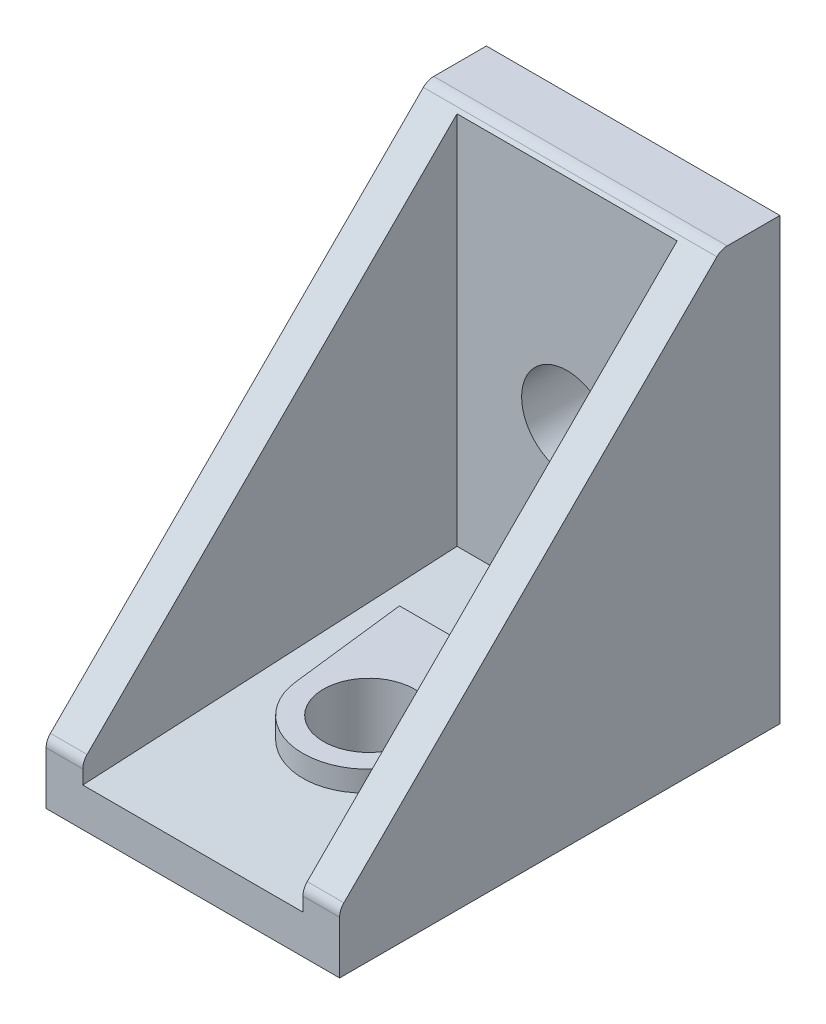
ISO-10303-21;
HEADER;
FILE_DESCRIPTION(('STEP AP214'),'2;1');
FILE_NAME('part.step','',(''),(''),'','','');
FILE_SCHEMA(('AUTOMOTIVE_DESIGN { 1 0 10303 214 1 1 1 1 }'));
ENDSEC;
DATA;
#1=APPLICATION_CONTEXT('core data for automotive mechanical design processes');
#2=APPLICATION_PROTOCOL_DEFINITION('international standard','automotive_design',2000,#1);
#3=PRODUCT_CONTEXT('',#1,'mechanical');
#4=PRODUCT('Part','Part','',(#3));
#5=PRODUCT_RELATED_PRODUCT_CATEGORY('part','',(#4));
#6=PRODUCT_DEFINITION_FORMATION('','',#4);
#7=PRODUCT_DEFINITION_CONTEXT('part definition',#1,'design');
#8=PRODUCT_DEFINITION('design','',#6,#7);
#9=PRODUCT_DEFINITION_SHAPE('','',#8);
#10=(LENGTH_UNIT() NAMED_UNIT(*) SI_UNIT(.MILLI.,.METRE.));
#11=(NAMED_UNIT(*) PLANE_ANGLE_UNIT() SI_UNIT($,.RADIAN.));
#12=(NAMED_UNIT(*) SI_UNIT($,.STERADIAN.) SOLID_ANGLE_UNIT());
#13=UNCERTAINTY_MEASURE_WITH_UNIT(LENGTH_MEASURE(1.E-05),#10,'distance_accuracy_value','');
#14=(GEOMETRIC_REPRESENTATION_CONTEXT(3) GLOBAL_UNCERTAINTY_ASSIGNED_CONTEXT((#13)) GLOBAL_UNIT_ASSIGNED_CONTEXT((#10,
#11,#12)) REPRESENTATION_CONTEXT('',''));
#15=CARTESIAN_POINT('',(0.,0.,0.));
#16=DIRECTION('',(0.,0.,1.));
#17=DIRECTION('',(1.,0.,0.));
#18=AXIS2_PLACEMENT_3D('',#15,#16,#17);
#19=CARTESIAN_POINT('',(10.,29.7071067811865,4.29310678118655));
#20=DIRECTION('',(0.,-0.707106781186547,-0.707106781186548));
#21=DIRECTION('',(0.,0.707106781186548,-0.707106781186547));
#22=AXIS2_PLACEMENT_3D('',#19,#20,#21);
#23=PLANE('',#22);
#24=DIRECTION('',(0.,-0.707106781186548,0.707106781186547));
#25=VECTOR('',#24,1.);
#26=CARTESIAN_POINT('',(-7.5,29.7071067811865,4.29310678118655));
#27=LINE('',#26,#25);
#28=CARTESIAN_POINT('',(-7.5,29.5002135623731,4.5));
#29=VERTEX_POINT('',#28);
#30=CARTESIAN_POINT('',(-7.5,4.29310678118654,29.7071067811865));
#31=VERTEX_POINT('',#30);
#32=EDGE_CURVE('E285',#29,#31,#27,.T.);
#33=ORIENTED_EDGE('',*,*,#32,.F.);
#34=DIRECTION('',(1.,0.,0.));
#35=VECTOR('',#34,1.);
#36=CARTESIAN_POINT('',(10.,29.5002135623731,4.5));
#37=LINE('',#36,#35);
#38=CARTESIAN_POINT('',(7.5,29.5002135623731,4.5));
#39=VERTEX_POINT('',#38);
#40=EDGE_CURVE('E11',#29,#39,#37,.T.);
#41=ORIENTED_EDGE('',*,*,#40,.T.);
#42=DIRECTION('',(0.,-0.707106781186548,0.707106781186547));
#43=VECTOR('',#42,1.);
#44=CARTESIAN_POINT('',(7.5,29.7071067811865,4.29310678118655));
#45=LINE('',#44,#43);
#46=CARTESIAN_POINT('',(7.5,4.29310678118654,29.7071067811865));
#47=VERTEX_POINT('',#46);
#48=EDGE_CURVE('E280',#39,#47,#45,.T.);
#49=ORIENTED_EDGE('',*,*,#48,.T.);
#50=DIRECTION('',(-1.,0.,0.));
#51=VECTOR('',#50,1.);
#52=CARTESIAN_POINT('',(10.,4.29310678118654,29.7071067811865));
#53=LINE('',#52,#51);
#54=CARTESIAN_POINT('',(10.,4.29310678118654,29.7071067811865));
#55=VERTEX_POINT('',#54);
#56=EDGE_CURVE('E463',#55,#47,#53,.T.);
#57=ORIENTED_EDGE('',*,*,#56,.F.);
#58=DIRECTION('',(0.,-0.707106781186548,0.707106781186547));
#59=VECTOR('',#58,1.);
#60=CARTESIAN_POINT('',(10.,29.7071067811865,4.29310678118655));
#61=LINE('',#60,#59);
#62=CARTESIAN_POINT('',(10.,29.7071067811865,4.29310678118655));
#63=VERTEX_POINT('',#62);
#64=EDGE_CURVE('E424',#63,#55,#61,.T.);
#65=ORIENTED_EDGE('',*,*,#64,.F.);
#66=DIRECTION('',(-1.,0.,0.));
#67=VECTOR('',#66,1.);
#68=CARTESIAN_POINT('',(10.,29.7071067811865,4.29310678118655));
#69=LINE('',#68,#67);
#70=CARTESIAN_POINT('',(-10.,29.7071067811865,4.29310678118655));
#71=VERTEX_POINT('',#70);
#72=EDGE_CURVE('E466',#63,#71,#69,.T.);
#73=ORIENTED_EDGE('',*,*,#72,.T.);
#74=DIRECTION('',(0.,-0.707106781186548,0.707106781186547));
#75=VECTOR('',#74,1.);
#76=CARTESIAN_POINT('',(-10.,29.7071067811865,4.29310678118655));
#77=LINE('',#76,#75);
#78=CARTESIAN_POINT('',(-10.,4.29310678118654,29.7071067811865));
#79=VERTEX_POINT('',#78);
#80=EDGE_CURVE('E439',#71,#79,#77,.T.);
#81=ORIENTED_EDGE('',*,*,#80,.T.);
#82=EDGE_CURVE('E462',#31,#79,#53,.T.);
#83=ORIENTED_EDGE('',*,*,#82,.F.);
#84=EDGE_LOOP('',(#33,#41,#49,#57,#65,#73,#81,#83));
#85=FACE_BOUND('',#84,.T.);
#86=ADVANCED_FACE('F16',(#85),#23,.F.);
#87=CARTESIAN_POINT('',(10.,3.586,29.));
#88=DIRECTION('',(-1.,0.,0.));
#89=DIRECTION('',(0.,0.,1.));
#90=AXIS2_PLACEMENT_3D('',#87,#88,#89);
#91=CYLINDRICAL_SURFACE('',#90,1.);
#92=CARTESIAN_POINT('',(-7.5,3.586,29.));
#93=DIRECTION('',(1.,0.,0.));
#94=DIRECTION('',(0.,0.,-1.));
#95=AXIS2_PLACEMENT_3D('',#92,#93,#94);
#96=CIRCLE('',#95,1.);
#97=CARTESIAN_POINT('',(-7.5,3.586,30.));
#98=VERTEX_POINT('',#97);
#99=EDGE_CURVE('E283',#31,#98,#96,.T.);
#100=ORIENTED_EDGE('',*,*,#99,.F.);
#101=ORIENTED_EDGE('',*,*,#82,.T.);
#102=CARTESIAN_POINT('',(-10.,3.586,29.));
#103=DIRECTION('',(1.,0.,0.));
#104=DIRECTION('',(0.,0.,1.));
#105=AXIS2_PLACEMENT_3D('',#102,#103,#104);
#106=CIRCLE('',#105,1.);
#107=CARTESIAN_POINT('',(-10.,3.586,30.));
#108=VERTEX_POINT('',#107);
#109=EDGE_CURVE('E442',#79,#108,#106,.T.);
#110=ORIENTED_EDGE('',*,*,#109,.T.);
#111=DIRECTION('',(-1.,0.,0.));
#112=VECTOR('',#111,1.);
#113=CARTESIAN_POINT('',(10.,3.586,30.));
#114=LINE('',#113,#112);
#115=EDGE_CURVE('E458',#98,#108,#114,.T.);
#116=ORIENTED_EDGE('',*,*,#115,.F.);
#117=EDGE_LOOP('',(#100,#101,#110,#116));
#118=FACE_BOUND('',#117,.T.);
#119=ADVANCED_FACE('F502',(#118),#91,.T.);
#120=CARTESIAN_POINT('',(10.,3.586,30.));
#121=DIRECTION('',(0.,0.,-1.));
#122=DIRECTION('',(0.,1.,0.));
#123=AXIS2_PLACEMENT_3D('',#120,#121,#122);
#124=PLANE('',#123);
#125=DIRECTION('',(0.,-1.,0.));
#126=VECTOR('',#125,1.);
#127=CARTESIAN_POINT('',(-7.5,3.586,30.));
#128=LINE('',#127,#126);
#129=CARTESIAN_POINT('',(-7.5,2.63760162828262,30.));
#130=VERTEX_POINT('',#129);
#131=EDGE_CURVE('E24',#98,#130,#128,.T.);
#132=ORIENTED_EDGE('',*,*,#131,.F.);
#133=ORIENTED_EDGE('',*,*,#115,.T.);
#134=DIRECTION('',(0.,-1.,0.));
#135=VECTOR('',#134,1.);
#136=CARTESIAN_POINT('',(-10.,3.586,30.));
#137=LINE('',#136,#135);
#138=CARTESIAN_POINT('',(-10.,0.,30.));
#139=VERTEX_POINT('',#138);
#140=EDGE_CURVE('E445',#108,#139,#137,.T.);
#141=ORIENTED_EDGE('',*,*,#140,.T.);
#142=DIRECTION('',(-1.,0.,0.));
#143=VECTOR('',#142,1.);
#144=CARTESIAN_POINT('',(10.,0.,30.));
#145=LINE('',#144,#143);
#146=CARTESIAN_POINT('',(10.,0.,30.));
#147=VERTEX_POINT('',#146);
#148=EDGE_CURVE('E455',#147,#139,#145,.T.);
#149=ORIENTED_EDGE('',*,*,#148,.F.);
#150=DIRECTION('',(0.,-1.,0.));
#151=VECTOR('',#150,1.);
#152=CARTESIAN_POINT('',(10.,3.586,30.));
#153=LINE('',#152,#151);
#154=CARTESIAN_POINT('',(10.,3.586,30.));
#155=VERTEX_POINT('',#154);
#156=EDGE_CURVE('E428',#155,#147,#153,.T.);
#157=ORIENTED_EDGE('',*,*,#156,.F.);
#158=CARTESIAN_POINT('',(7.5,3.586,30.));
#159=VERTEX_POINT('',#158);
#160=EDGE_CURVE('E459',#155,#159,#114,.T.);
#161=ORIENTED_EDGE('',*,*,#160,.T.);
#162=DIRECTION('',(0.,-1.,0.));
#163=VECTOR('',#162,1.);
#164=CARTESIAN_POINT('',(7.5,3.586,30.));
#165=LINE('',#164,#163);
#166=CARTESIAN_POINT('',(7.5,2.63760162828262,30.));
#167=VERTEX_POINT('',#166);
#168=EDGE_CURVE('E472',#159,#167,#165,.T.);
#169=ORIENTED_EDGE('',*,*,#168,.T.);
#170=DIRECTION('',(1.,0.,0.));
#171=VECTOR('',#170,1.);
#172=CARTESIAN_POINT('',(-7.5,2.63760162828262,30.));
#173=LINE('',#172,#171);
#174=EDGE_CURVE('E270',#130,#167,#173,.T.);
#175=ORIENTED_EDGE('',*,*,#174,.F.);
#176=EDGE_LOOP('',(#132,#133,#141,#149,#157,#161,#169,#175));
#177=FACE_BOUND('',#176,.T.);
#178=ADVANCED_FACE('F485',(#177),#124,.F.);
#179=CARTESIAN_POINT('',(10.,30.,0.));
#180=DIRECTION('',(0.,-1.,0.));
#181=DIRECTION('',(0.,0.,-1.));
#182=AXIS2_PLACEMENT_3D('',#179,#180,#181);
#183=PLANE('',#182);
#184=DIRECTION('',(0.,0.,1.));
#185=VECTOR('',#184,1.);
#186=CARTESIAN_POINT('',(-10.,30.,0.));
#187=LINE('',#186,#185);
#188=CARTESIAN_POINT('',(-10.,30.,0.));
#189=VERTEX_POINT('',#188);
#190=CARTESIAN_POINT('',(-10.,30.,3.586));
#191=VERTEX_POINT('',#190);
#192=EDGE_CURVE('E403',#189,#191,#187,.T.);
#193=ORIENTED_EDGE('',*,*,#192,.T.);
#194=DIRECTION('',(-1.,0.,0.));
#195=VECTOR('',#194,1.);
#196=CARTESIAN_POINT('',(10.,30.,3.586));
#197=LINE('',#196,#195);
#198=CARTESIAN_POINT('',(10.,30.,3.586));
#199=VERTEX_POINT('',#198);
#200=EDGE_CURVE('E469',#199,#191,#197,.T.);
#201=ORIENTED_EDGE('',*,*,#200,.F.);
#202=DIRECTION('',(0.,0.,1.));
#203=VECTOR('',#202,1.);
#204=CARTESIAN_POINT('',(10.,30.,0.));
#205=LINE('',#204,#203);
#206=CARTESIAN_POINT('',(10.,30.,0.));
#207=VERTEX_POINT('',#206);
#208=EDGE_CURVE('E418',#207,#199,#205,.T.);
#209=ORIENTED_EDGE('',*,*,#208,.F.);
#210=DIRECTION('',(-1.,0.,0.));
#211=VECTOR('',#210,1.);
#212=CARTESIAN_POINT('',(10.,30.,0.));
#213=LINE('',#212,#211);
#214=EDGE_CURVE('E434',#207,#189,#213,.T.);
#215=ORIENTED_EDGE('',*,*,#214,.T.);
#216=EDGE_LOOP('',(#193,#201,#209,#215));
#217=FACE_BOUND('',#216,.T.);
#218=ADVANCED_FACE('F18',(#217),#183,.F.);
#219=CARTESIAN_POINT('',(10.,29.,3.586));
#220=DIRECTION('',(-1.,0.,0.));
#221=DIRECTION('',(0.,0.,1.));
#222=AXIS2_PLACEMENT_3D('',#219,#220,#221);
#223=CYLINDRICAL_SURFACE('',#222,1.);
#224=CARTESIAN_POINT('',(-10.,29.,3.586));
#225=DIRECTION('',(1.,0.,0.));
#226=DIRECTION('',(0.,0.,1.));
#227=AXIS2_PLACEMENT_3D('',#224,#225,#226);
#228=CIRCLE('',#227,1.);
#229=EDGE_CURVE('E437',#191,#71,#228,.T.);
#230=ORIENTED_EDGE('',*,*,#229,.T.);
#231=ORIENTED_EDGE('',*,*,#72,.F.);
#232=CARTESIAN_POINT('',(10.,29.,3.586));
#233=DIRECTION('',(1.,0.,0.));
#234=DIRECTION('',(0.,0.,1.));
#235=AXIS2_PLACEMENT_3D('',#232,#233,#234);
#236=CIRCLE('',#235,1.);
#237=EDGE_CURVE('E421',#199,#63,#236,.T.);
#238=ORIENTED_EDGE('',*,*,#237,.F.);
#239=ORIENTED_EDGE('',*,*,#200,.T.);
#240=EDGE_LOOP('',(#230,#231,#238,#239));
#241=FACE_BOUND('',#240,.T.);
#242=ADVANCED_FACE('F525',(#241),#223,.T.);
#243=ORIENTED_EDGE('',*,*,#56,.T.);
#244=CARTESIAN_POINT('',(7.5,3.586,29.));
#245=DIRECTION('',(1.,0.,0.));
#246=DIRECTION('',(0.,0.,-1.));
#247=AXIS2_PLACEMENT_3D('',#244,#245,#246);
#248=CIRCLE('',#247,1.);
#249=EDGE_CURVE('E276',#47,#159,#248,.T.);
#250=ORIENTED_EDGE('',*,*,#249,.T.);
#251=ORIENTED_EDGE('',*,*,#160,.F.);
#252=CARTESIAN_POINT('',(10.,3.586,29.));
#253=DIRECTION('',(1.,0.,0.));
#254=DIRECTION('',(0.,0.,1.));
#255=AXIS2_PLACEMENT_3D('',#252,#253,#254);
#256=CIRCLE('',#255,1.);
#257=EDGE_CURVE('E426',#55,#155,#256,.T.);
#258=ORIENTED_EDGE('',*,*,#257,.F.);
#259=EDGE_LOOP('',(#243,#250,#251,#258));
#260=FACE_BOUND('',#259,.T.);
#261=ADVANCED_FACE('F490',(#260),#91,.T.);
#262=CARTESIAN_POINT('',(10.,0.,0.));
#263=DIRECTION('',(0.,1.,0.));
#264=DIRECTION('',(0.,0.,1.));
#265=AXIS2_PLACEMENT_3D('',#262,#263,#264);
#266=PLANE('',#265);
#267=CARTESIAN_POINT('',(0.,0.,18.));
#268=DIRECTION('',(0.,-1.,0.));
#269=DIRECTION('',(0.,0.,-1.));
#270=AXIS2_PLACEMENT_3D('',#267,#268,#269);
#271=CIRCLE('',#270,3.1);
#272=CARTESIAN_POINT('',(0.,0.,14.9));
#273=VERTEX_POINT('',#272);
#274=EDGE_CURVE('E660',#273,#273,#271,.T.);
#275=ORIENTED_EDGE('',*,*,#274,.F.);
#276=EDGE_LOOP('',(#275));
#277=FACE_BOUND('',#276,.T.);
#278=DIRECTION('',(0.,0.,-1.));
#279=VECTOR('',#278,1.);
#280=CARTESIAN_POINT('',(4.,0.,26.7));
#281=LINE('',#280,#279);
#282=CARTESIAN_POINT('',(4.,0.,26.7));
#283=VERTEX_POINT('',#282);
#284=CARTESIAN_POINT('',(4.,0.,24.3));
#285=VERTEX_POINT('',#284);
#286=EDGE_CURVE('E292',#283,#285,#281,.T.);
#287=ORIENTED_EDGE('',*,*,#286,.T.);
#288=CARTESIAN_POINT('',(3.7,0.,24.3));
#289=DIRECTION('',(0.,1.,0.));
#290=DIRECTION('',(0.,0.,1.));
#291=AXIS2_PLACEMENT_3D('',#288,#289,#290);
#292=CIRCLE('',#291,0.300000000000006);
#293=CARTESIAN_POINT('',(3.7,0.,24.));
#294=VERTEX_POINT('',#293);
#295=EDGE_CURVE('E287',#285,#294,#292,.T.);
#296=ORIENTED_EDGE('',*,*,#295,.T.);
#297=DIRECTION('',(-1.,0.,0.));
#298=VECTOR('',#297,1.);
#299=CARTESIAN_POINT('',(-3.7,0.,24.));
#300=LINE('',#299,#298);
#301=CARTESIAN_POINT('',(-3.7,0.,24.));
#302=VERTEX_POINT('',#301);
#303=EDGE_CURVE('E316',#294,#302,#300,.T.);
#304=ORIENTED_EDGE('',*,*,#303,.T.);
#305=CARTESIAN_POINT('',(-3.7,0.,24.3));
#306=DIRECTION('',(0.,1.,0.));
#307=DIRECTION('',(0.,0.,-1.));
#308=AXIS2_PLACEMENT_3D('',#305,#306,#307);
#309=CIRCLE('',#308,0.300000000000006);
#310=CARTESIAN_POINT('',(-4.,0.,24.3));
#311=VERTEX_POINT('',#310);
#312=EDGE_CURVE('E319',#302,#311,#309,.T.);
#313=ORIENTED_EDGE('',*,*,#312,.T.);
#314=DIRECTION('',(0.,0.,1.));
#315=VECTOR('',#314,1.);
#316=CARTESIAN_POINT('',(-4.,0.,26.7));
#317=LINE('',#316,#315);
#318=CARTESIAN_POINT('',(-4.00000000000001,0.,26.7));
#319=VERTEX_POINT('',#318);
#320=EDGE_CURVE('E322',#311,#319,#317,.T.);
#321=ORIENTED_EDGE('',*,*,#320,.T.);
#322=CARTESIAN_POINT('',(-3.7,0.,26.7));
#323=DIRECTION('',(0.,1.,0.));
#324=DIRECTION('',(0.,0.,-1.));
#325=AXIS2_PLACEMENT_3D('',#322,#323,#324);
#326=CIRCLE('',#325,0.300000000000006);
#327=CARTESIAN_POINT('',(-3.7,0.,27.));
#328=VERTEX_POINT('',#327);
#329=EDGE_CURVE('E325',#319,#328,#326,.T.);
#330=ORIENTED_EDGE('',*,*,#329,.T.);
#331=DIRECTION('',(1.,0.,0.));
#332=VECTOR('',#331,1.);
#333=CARTESIAN_POINT('',(-3.7,0.,27.));
#334=LINE('',#333,#332);
#335=CARTESIAN_POINT('',(3.7,0.,27.));
#336=VERTEX_POINT('',#335);
#337=EDGE_CURVE('E328',#328,#336,#334,.T.);
#338=ORIENTED_EDGE('',*,*,#337,.T.);
#339=CARTESIAN_POINT('',(3.7,0.,26.7));
#340=DIRECTION('',(0.,1.,0.));
#341=DIRECTION('',(0.,0.,-1.));
#342=AXIS2_PLACEMENT_3D('',#339,#340,#341);
#343=CIRCLE('',#342,0.300000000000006);
#344=EDGE_CURVE('E331',#336,#283,#343,.T.);
#345=ORIENTED_EDGE('',*,*,#344,.T.);
#346=EDGE_LOOP('',(#287,#296,#304,#313,#321,#330,#338,#345));
#347=FACE_BOUND('',#346,.T.);
#348=DIRECTION('',(-1.,0.,0.));
#349=VECTOR('',#348,1.);
#350=CARTESIAN_POINT('',(-3.7,0.,5.));
#351=LINE('',#350,#349);
#352=CARTESIAN_POINT('',(3.7,0.,5.));
#353=VERTEX_POINT('',#352);
#354=CARTESIAN_POINT('',(-3.7,0.,5.));
#355=VERTEX_POINT('',#354);
#356=EDGE_CURVE('E357',#353,#355,#351,.T.);
#357=ORIENTED_EDGE('',*,*,#356,.T.);
#358=CARTESIAN_POINT('',(-3.7,0.,5.3));
#359=DIRECTION('',(0.,1.,0.));
#360=DIRECTION('',(0.,0.,-1.));
#361=AXIS2_PLACEMENT_3D('',#358,#359,#360);
#362=CIRCLE('',#361,0.299999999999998);
#363=CARTESIAN_POINT('',(-4.,0.,5.3));
#364=VERTEX_POINT('',#363);
#365=EDGE_CURVE('E338',#355,#364,#362,.T.);
#366=ORIENTED_EDGE('',*,*,#365,.T.);
#367=DIRECTION('',(0.,0.,1.));
#368=VECTOR('',#367,1.);
#369=CARTESIAN_POINT('',(-4.,0.,5.3));
#370=LINE('',#369,#368);
#371=CARTESIAN_POINT('',(-4.,0.,12.7));
#372=VERTEX_POINT('',#371);
#373=EDGE_CURVE('E381',#364,#372,#370,.T.);
#374=ORIENTED_EDGE('',*,*,#373,.T.);
#375=CARTESIAN_POINT('',(-3.7,0.,12.7));
#376=DIRECTION('',(0.,1.,0.));
#377=DIRECTION('',(0.,0.,1.));
#378=AXIS2_PLACEMENT_3D('',#375,#376,#377);
#379=CIRCLE('',#378,0.299999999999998);
#380=CARTESIAN_POINT('',(-3.7,0.,13.));
#381=VERTEX_POINT('',#380);
#382=EDGE_CURVE('E384',#372,#381,#379,.T.);
#383=ORIENTED_EDGE('',*,*,#382,.T.);
#384=DIRECTION('',(1.,0.,0.));
#385=VECTOR('',#384,1.);
#386=CARTESIAN_POINT('',(-3.7,0.,13.));
#387=LINE('',#386,#385);
#388=CARTESIAN_POINT('',(3.7,0.,13.));
#389=VERTEX_POINT('',#388);
#390=EDGE_CURVE('E387',#381,#389,#387,.T.);
#391=ORIENTED_EDGE('',*,*,#390,.T.);
#392=CARTESIAN_POINT('',(3.7,0.,12.7));
#393=DIRECTION('',(0.,1.,0.));
#394=DIRECTION('',(0.,0.,1.));
#395=AXIS2_PLACEMENT_3D('',#392,#393,#394);
#396=CIRCLE('',#395,0.299999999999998);
#397=CARTESIAN_POINT('',(4.,0.,12.7));
#398=VERTEX_POINT('',#397);
#399=EDGE_CURVE('E390',#389,#398,#396,.T.);
#400=ORIENTED_EDGE('',*,*,#399,.T.);
#401=DIRECTION('',(0.,0.,-1.));
#402=VECTOR('',#401,1.);
#403=CARTESIAN_POINT('',(4.,0.,5.3));
#404=LINE('',#403,#402);
#405=CARTESIAN_POINT('',(4.,0.,5.3));
#406=VERTEX_POINT('',#405);
#407=EDGE_CURVE('E393',#398,#406,#404,.T.);
#408=ORIENTED_EDGE('',*,*,#407,.T.);
#409=CARTESIAN_POINT('',(3.7,0.,5.3));
#410=DIRECTION('',(0.,1.,0.));
#411=DIRECTION('',(0.,0.,1.));
#412=AXIS2_PLACEMENT_3D('',#409,#410,#411);
#413=CIRCLE('',#412,0.299999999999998);
#414=EDGE_CURVE('E396',#406,#353,#413,.T.);
#415=ORIENTED_EDGE('',*,*,#414,.T.);
#416=EDGE_LOOP('',(#357,#366,#374,#383,#391,#400,#408,#415));
#417=FACE_BOUND('',#416,.T.);
#418=DIRECTION('',(0.,0.,-1.));
#419=VECTOR('',#418,1.);
#420=CARTESIAN_POINT('',(-10.,0.,0.));
#421=LINE('',#420,#419);
#422=CARTESIAN_POINT('',(-10.,0.,0.));
#423=VERTEX_POINT('',#422);
#424=EDGE_CURVE('E447',#139,#423,#421,.T.);
#425=ORIENTED_EDGE('',*,*,#424,.T.);
#426=DIRECTION('',(-1.,0.,0.));
#427=VECTOR('',#426,1.);
#428=CARTESIAN_POINT('',(10.,0.,0.));
#429=LINE('',#428,#427);
#430=CARTESIAN_POINT('',(10.,0.,0.));
#431=VERTEX_POINT('',#430);
#432=EDGE_CURVE('E452',#431,#423,#429,.T.);
#433=ORIENTED_EDGE('',*,*,#432,.F.);
#434=DIRECTION('',(0.,0.,-1.));
#435=VECTOR('',#434,1.);
#436=CARTESIAN_POINT('',(10.,0.,0.));
#437=LINE('',#436,#435);
#438=EDGE_CURVE('E430',#147,#431,#437,.T.);
#439=ORIENTED_EDGE('',*,*,#438,.F.);
#440=ORIENTED_EDGE('',*,*,#148,.T.);
#441=EDGE_LOOP('',(#425,#433,#439,#440));
#442=FACE_BOUND('',#441,.T.);
#443=ADVANCED_FACE('F509',(#277,#347,#417,#442),#266,.F.);
#444=CARTESIAN_POINT('',(10.,30.,0.));
#445=DIRECTION('',(0.,0.,1.));
#446=DIRECTION('',(0.,-1.,0.));
#447=AXIS2_PLACEMENT_3D('',#444,#445,#446);
#448=PLANE('',#447);
#449=CARTESIAN_POINT('',(0.,15.,0.));
#450=DIRECTION('',(0.,0.,-1.));
#451=DIRECTION('',(-1.,0.,0.));
#452=AXIS2_PLACEMENT_3D('',#449,#450,#451);
#453=CIRCLE('',#452,3.1);
#454=CARTESIAN_POINT('',(-3.1,15.,0.));
#455=VERTEX_POINT('',#454);
#456=EDGE_CURVE('E670',#455,#455,#453,.T.);
#457=ORIENTED_EDGE('',*,*,#456,.F.);
#458=EDGE_LOOP('',(#457));
#459=FACE_BOUND('',#458,.T.);
#460=DIRECTION('',(0.,1.,0.));
#461=VECTOR('',#460,1.);
#462=CARTESIAN_POINT('',(-10.,30.,0.));
#463=LINE('',#462,#461);
#464=EDGE_CURVE('E422',#423,#189,#463,.T.);
#465=ORIENTED_EDGE('',*,*,#464,.T.);
#466=ORIENTED_EDGE('',*,*,#214,.F.);
#467=DIRECTION('',(0.,1.,0.));
#468=VECTOR('',#467,1.);
#469=CARTESIAN_POINT('',(10.,30.,0.));
#470=LINE('',#469,#468);
#471=EDGE_CURVE('E432',#431,#207,#470,.T.);
#472=ORIENTED_EDGE('',*,*,#471,.F.);
#473=ORIENTED_EDGE('',*,*,#432,.T.);
#474=EDGE_LOOP('',(#465,#466,#472,#473));
#475=FACE_BOUND('',#474,.T.);
#476=ADVANCED_FACE('F516',(#459,#475),#448,.F.);
#477=CARTESIAN_POINT('',(10.,29.,3.586));
#478=DIRECTION('',(-1.,0.,0.));
#479=DIRECTION('',(0.,0.,1.));
#480=AXIS2_PLACEMENT_3D('',#477,#478,#479);
#481=PLANE('',#480);
#482=ORIENTED_EDGE('',*,*,#208,.T.);
#483=ORIENTED_EDGE('',*,*,#237,.T.);
#484=ORIENTED_EDGE('',*,*,#64,.T.);
#485=ORIENTED_EDGE('',*,*,#257,.T.);
#486=ORIENTED_EDGE('',*,*,#156,.T.);
#487=ORIENTED_EDGE('',*,*,#438,.T.);
#488=ORIENTED_EDGE('',*,*,#471,.T.);
#489=EDGE_LOOP('',(#482,#483,#484,#485,#486,#487,#488));
#490=FACE_BOUND('',#489,.T.);
#491=ADVANCED_FACE('F522',(#490),#481,.F.);
#492=CARTESIAN_POINT('',(-10.,29.,3.586));
#493=DIRECTION('',(-1.,0.,0.));
#494=DIRECTION('',(0.,0.,1.));
#495=AXIS2_PLACEMENT_3D('',#492,#493,#494);
#496=PLANE('',#495);
#497=ORIENTED_EDGE('',*,*,#192,.F.);
#498=ORIENTED_EDGE('',*,*,#464,.F.);
#499=ORIENTED_EDGE('',*,*,#424,.F.);
#500=ORIENTED_EDGE('',*,*,#140,.F.);
#501=ORIENTED_EDGE('',*,*,#109,.F.);
#502=ORIENTED_EDGE('',*,*,#80,.F.);
#503=ORIENTED_EDGE('',*,*,#229,.F.);
#504=EDGE_LOOP('',(#497,#498,#499,#500,#501,#502,#503));
#505=FACE_BOUND('',#504,.T.);
#506=ADVANCED_FACE('F513',(#505),#496,.T.);
#507=CARTESIAN_POINT('',(-3.7,-1.,5.3));
#508=DIRECTION('',(0.,1.,0.));
#509=DIRECTION('',(0.,0.,1.));
#510=AXIS2_PLACEMENT_3D('',#507,#508,#509);
#511=CYLINDRICAL_SURFACE('',#510,0.299999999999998);
#512=ORIENTED_EDGE('',*,*,#365,.F.);
#513=DIRECTION('',(0.,1.,0.));
#514=VECTOR('',#513,1.);
#515=CARTESIAN_POINT('',(-3.7,-1.,5.));
#516=LINE('',#515,#514);
#517=CARTESIAN_POINT('',(-3.7,-1.,5.));
#518=VERTEX_POINT('',#517);
#519=EDGE_CURVE('E401',#518,#355,#516,.T.);
#520=ORIENTED_EDGE('',*,*,#519,.F.);
#521=CARTESIAN_POINT('',(-3.7,-1.,5.3));
#522=DIRECTION('',(0.,1.,0.));
#523=DIRECTION('',(0.,0.,-1.));
#524=AXIS2_PLACEMENT_3D('',#521,#522,#523);
#525=CIRCLE('',#524,0.299999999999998);
#526=CARTESIAN_POINT('',(-4.,-1.,5.3));
#527=VERTEX_POINT('',#526);
#528=EDGE_CURVE('E353',#518,#527,#525,.T.);
#529=ORIENTED_EDGE('',*,*,#528,.T.);
#530=DIRECTION('',(0.,1.,0.));
#531=VECTOR('',#530,1.);
#532=CARTESIAN_POINT('',(-4.,-1.,5.3));
#533=LINE('',#532,#531);
#534=EDGE_CURVE('E378',#527,#364,#533,.T.);
#535=ORIENTED_EDGE('',*,*,#534,.T.);
#536=EDGE_LOOP('',(#512,#520,#529,#535));
#537=FACE_BOUND('',#536,.T.);
#538=ADVANCED_FACE('F549',(#537),#511,.T.);
#539=CARTESIAN_POINT('',(-3.7,-1.,5.));
#540=DIRECTION('',(0.,0.,-1.));
#541=DIRECTION('',(-1.,0.,0.));
#542=AXIS2_PLACEMENT_3D('',#539,#540,#541);
#543=PLANE('',#542);
#544=ORIENTED_EDGE('',*,*,#356,.F.);
#545=DIRECTION('',(0.,1.,0.));
#546=VECTOR('',#545,1.);
#547=CARTESIAN_POINT('',(3.7,-1.,5.));
#548=LINE('',#547,#546);
#549=CARTESIAN_POINT('',(3.7,-1.,5.));
#550=VERTEX_POINT('',#549);
#551=EDGE_CURVE('E404',#550,#353,#548,.T.);
#552=ORIENTED_EDGE('',*,*,#551,.F.);
#553=DIRECTION('',(-1.,0.,0.));
#554=VECTOR('',#553,1.);
#555=CARTESIAN_POINT('',(-3.7,-1.,5.));
#556=LINE('',#555,#554);
#557=EDGE_CURVE('E375',#550,#518,#556,.T.);
#558=ORIENTED_EDGE('',*,*,#557,.T.);
#559=ORIENTED_EDGE('',*,*,#519,.T.);
#560=EDGE_LOOP('',(#544,#552,#558,#559));
#561=FACE_BOUND('',#560,.T.);
#562=ADVANCED_FACE('F554',(#561),#543,.T.);
#563=CARTESIAN_POINT('',(3.7,-1.,5.3));
#564=DIRECTION('',(0.,1.,0.));
#565=DIRECTION('',(0.,0.,1.));
#566=AXIS2_PLACEMENT_3D('',#563,#564,#565);
#567=CYLINDRICAL_SURFACE('',#566,0.299999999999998);
#568=ORIENTED_EDGE('',*,*,#414,.F.);
#569=DIRECTION('',(0.,1.,0.));
#570=VECTOR('',#569,1.);
#571=CARTESIAN_POINT('',(4.,-1.,5.3));
#572=LINE('',#571,#570);
#573=CARTESIAN_POINT('',(4.,-1.,5.3));
#574=VERTEX_POINT('',#573);
#575=EDGE_CURVE('E406',#574,#406,#572,.T.);
#576=ORIENTED_EDGE('',*,*,#575,.F.);
#577=CARTESIAN_POINT('',(3.7,-1.,5.3));
#578=DIRECTION('',(0.,1.,0.));
#579=DIRECTION('',(0.,0.,1.));
#580=AXIS2_PLACEMENT_3D('',#577,#578,#579);
#581=CIRCLE('',#580,0.299999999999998);
#582=EDGE_CURVE('E372',#574,#550,#581,.T.);
#583=ORIENTED_EDGE('',*,*,#582,.T.);
#584=ORIENTED_EDGE('',*,*,#551,.T.);
#585=EDGE_LOOP('',(#568,#576,#583,#584));
#586=FACE_BOUND('',#585,.T.);
#587=ADVANCED_FACE('F576',(#586),#567,.T.);
#588=CARTESIAN_POINT('',(4.,-1.,5.3));
#589=DIRECTION('',(1.,0.,0.));
#590=DIRECTION('',(0.,0.,-1.));
#591=AXIS2_PLACEMENT_3D('',#588,#589,#590);
#592=PLANE('',#591);
#593=ORIENTED_EDGE('',*,*,#407,.F.);
#594=DIRECTION('',(0.,1.,0.));
#595=VECTOR('',#594,1.);
#596=CARTESIAN_POINT('',(4.,-1.,12.7));
#597=LINE('',#596,#595);
#598=CARTESIAN_POINT('',(4.,-1.,12.7));
#599=VERTEX_POINT('',#598);
#600=EDGE_CURVE('E408',#599,#398,#597,.T.);
#601=ORIENTED_EDGE('',*,*,#600,.F.);
#602=DIRECTION('',(0.,0.,-1.));
#603=VECTOR('',#602,1.);
#604=CARTESIAN_POINT('',(4.,-1.,5.3));
#605=LINE('',#604,#603);
#606=EDGE_CURVE('E369',#599,#574,#605,.T.);
#607=ORIENTED_EDGE('',*,*,#606,.T.);
#608=ORIENTED_EDGE('',*,*,#575,.T.);
#609=EDGE_LOOP('',(#593,#601,#607,#608));
#610=FACE_BOUND('',#609,.T.);
#611=ADVANCED_FACE('F572',(#610),#592,.T.);
#612=CARTESIAN_POINT('',(3.7,-1.,12.7));
#613=DIRECTION('',(0.,1.,0.));
#614=DIRECTION('',(0.,0.,1.));
#615=AXIS2_PLACEMENT_3D('',#612,#613,#614);
#616=CYLINDRICAL_SURFACE('',#615,0.299999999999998);
#617=ORIENTED_EDGE('',*,*,#399,.F.);
#618=DIRECTION('',(0.,1.,0.));
#619=VECTOR('',#618,1.);
#620=CARTESIAN_POINT('',(3.7,-1.,13.));
#621=LINE('',#620,#619);
#622=CARTESIAN_POINT('',(3.7,-1.,13.));
#623=VERTEX_POINT('',#622);
#624=EDGE_CURVE('E410',#623,#389,#621,.T.);
#625=ORIENTED_EDGE('',*,*,#624,.F.);
#626=CARTESIAN_POINT('',(3.7,-1.,12.7));
#627=DIRECTION('',(0.,1.,0.));
#628=DIRECTION('',(0.,0.,1.));
#629=AXIS2_PLACEMENT_3D('',#626,#627,#628);
#630=CIRCLE('',#629,0.299999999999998);
#631=EDGE_CURVE('E366',#623,#599,#630,.T.);
#632=ORIENTED_EDGE('',*,*,#631,.T.);
#633=ORIENTED_EDGE('',*,*,#600,.T.);
#634=EDGE_LOOP('',(#617,#625,#632,#633));
#635=FACE_BOUND('',#634,.T.);
#636=ADVANCED_FACE('F568',(#635),#616,.T.);
#637=CARTESIAN_POINT('',(-3.7,-1.,13.));
#638=DIRECTION('',(0.,0.,1.));
#639=DIRECTION('',(1.,0.,0.));
#640=AXIS2_PLACEMENT_3D('',#637,#638,#639);
#641=PLANE('',#640);
#642=ORIENTED_EDGE('',*,*,#390,.F.);
#643=DIRECTION('',(0.,1.,0.));
#644=VECTOR('',#643,1.);
#645=CARTESIAN_POINT('',(-3.7,-1.,13.));
#646=LINE('',#645,#644);
#647=CARTESIAN_POINT('',(-3.7,-1.,13.));
#648=VERTEX_POINT('',#647);
#649=EDGE_CURVE('E412',#648,#381,#646,.T.);
#650=ORIENTED_EDGE('',*,*,#649,.F.);
#651=DIRECTION('',(1.,0.,0.));
#652=VECTOR('',#651,1.);
#653=CARTESIAN_POINT('',(-3.7,-1.,13.));
#654=LINE('',#653,#652);
#655=EDGE_CURVE('E363',#648,#623,#654,.T.);
#656=ORIENTED_EDGE('',*,*,#655,.T.);
#657=ORIENTED_EDGE('',*,*,#624,.T.);
#658=EDGE_LOOP('',(#642,#650,#656,#657));
#659=FACE_BOUND('',#658,.T.);
#660=ADVANCED_FACE('F564',(#659),#641,.T.);
#661=CARTESIAN_POINT('',(-3.7,-1.,12.7));
#662=DIRECTION('',(0.,1.,0.));
#663=DIRECTION('',(0.,0.,1.));
#664=AXIS2_PLACEMENT_3D('',#661,#662,#663);
#665=CYLINDRICAL_SURFACE('',#664,0.299999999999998);
#666=ORIENTED_EDGE('',*,*,#382,.F.);
#667=DIRECTION('',(0.,1.,0.));
#668=VECTOR('',#667,1.);
#669=CARTESIAN_POINT('',(-4.,-1.,12.7));
#670=LINE('',#669,#668);
#671=CARTESIAN_POINT('',(-4.,-1.,12.7));
#672=VERTEX_POINT('',#671);
#673=EDGE_CURVE('E414',#672,#372,#670,.T.);
#674=ORIENTED_EDGE('',*,*,#673,.F.);
#675=CARTESIAN_POINT('',(-3.7,-1.,12.7));
#676=DIRECTION('',(0.,1.,0.));
#677=DIRECTION('',(0.,0.,1.));
#678=AXIS2_PLACEMENT_3D('',#675,#676,#677);
#679=CIRCLE('',#678,0.299999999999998);
#680=EDGE_CURVE('E360',#672,#648,#679,.T.);
#681=ORIENTED_EDGE('',*,*,#680,.T.);
#682=ORIENTED_EDGE('',*,*,#649,.T.);
#683=EDGE_LOOP('',(#666,#674,#681,#682));
#684=FACE_BOUND('',#683,.T.);
#685=ADVANCED_FACE('F560',(#684),#665,.T.);
#686=CARTESIAN_POINT('',(-4.,-1.,5.3));
#687=DIRECTION('',(-1.,0.,0.));
#688=DIRECTION('',(0.,0.,1.));
#689=AXIS2_PLACEMENT_3D('',#686,#687,#688);
#690=PLANE('',#689);
#691=ORIENTED_EDGE('',*,*,#373,.F.);
#692=ORIENTED_EDGE('',*,*,#534,.F.);
#693=DIRECTION('',(0.,0.,1.));
#694=VECTOR('',#693,1.);
#695=CARTESIAN_POINT('',(-4.,-1.,5.3));
#696=LINE('',#695,#694);
#697=EDGE_CURVE('E356',#527,#672,#696,.T.);
#698=ORIENTED_EDGE('',*,*,#697,.T.);
#699=ORIENTED_EDGE('',*,*,#673,.T.);
#700=EDGE_LOOP('',(#691,#692,#698,#699));
#701=FACE_BOUND('',#700,.T.);
#702=ADVANCED_FACE('F556',(#701),#690,.T.);
#703=CARTESIAN_POINT('',(-3.7,-1.,5.3));
#704=DIRECTION('',(0.,-1.,0.));
#705=DIRECTION('',(0.,0.,-1.));
#706=AXIS2_PLACEMENT_3D('',#703,#704,#705);
#707=PLANE('',#706);
#708=ORIENTED_EDGE('',*,*,#528,.F.);
#709=ORIENTED_EDGE('',*,*,#557,.F.);
#710=ORIENTED_EDGE('',*,*,#582,.F.);
#711=ORIENTED_EDGE('',*,*,#606,.F.);
#712=ORIENTED_EDGE('',*,*,#631,.F.);
#713=ORIENTED_EDGE('',*,*,#655,.F.);
#714=ORIENTED_EDGE('',*,*,#680,.F.);
#715=ORIENTED_EDGE('',*,*,#697,.F.);
#716=EDGE_LOOP('',(#708,#709,#710,#711,#712,#713,#714,#715));
#717=FACE_BOUND('',#716,.T.);
#718=ADVANCED_FACE('F559',(#717),#707,.T.);
#719=CARTESIAN_POINT('',(3.7,-1.,24.3));
#720=DIRECTION('',(0.,1.,0.));
#721=DIRECTION('',(0.,0.,1.));
#722=AXIS2_PLACEMENT_3D('',#719,#720,#721);
#723=CYLINDRICAL_SURFACE('',#722,0.300000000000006);
#724=ORIENTED_EDGE('',*,*,#295,.F.);
#725=DIRECTION('',(0.,1.,0.));
#726=VECTOR('',#725,1.);
#727=CARTESIAN_POINT('',(4.,-1.,24.3));
#728=LINE('',#727,#726);
#729=CARTESIAN_POINT('',(4.,-1.,24.3));
#730=VERTEX_POINT('',#729);
#731=EDGE_CURVE('E336',#730,#285,#728,.T.);
#732=ORIENTED_EDGE('',*,*,#731,.F.);
#733=CARTESIAN_POINT('',(3.7,-1.,24.3));
#734=DIRECTION('',(0.,1.,0.));
#735=DIRECTION('',(0.,0.,1.));
#736=AXIS2_PLACEMENT_3D('',#733,#734,#735);
#737=CIRCLE('',#736,0.300000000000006);
#738=CARTESIAN_POINT('',(3.7,-1.,24.));
#739=VERTEX_POINT('',#738);
#740=EDGE_CURVE('E288',#730,#739,#737,.T.);
#741=ORIENTED_EDGE('',*,*,#740,.T.);
#742=DIRECTION('',(0.,1.,0.));
#743=VECTOR('',#742,1.);
#744=CARTESIAN_POINT('',(3.7,-1.,24.));
#745=LINE('',#744,#743);
#746=EDGE_CURVE('E313',#739,#294,#745,.T.);
#747=ORIENTED_EDGE('',*,*,#746,.T.);
#748=EDGE_LOOP('',(#724,#732,#741,#747));
#749=FACE_BOUND('',#748,.T.);
#750=ADVANCED_FACE('F586',(#749),#723,.T.);
#751=CARTESIAN_POINT('',(4.,-1.,26.7));
#752=DIRECTION('',(1.,0.,0.));
#753=DIRECTION('',(0.,0.,-1.));
#754=AXIS2_PLACEMENT_3D('',#751,#752,#753);
#755=PLANE('',#754);
#756=ORIENTED_EDGE('',*,*,#286,.F.);
#757=DIRECTION('',(0.,1.,0.));
#758=VECTOR('',#757,1.);
#759=CARTESIAN_POINT('',(4.,-1.,26.7));
#760=LINE('',#759,#758);
#761=CARTESIAN_POINT('',(4.,-1.,26.7));
#762=VERTEX_POINT('',#761);
#763=EDGE_CURVE('E339',#762,#283,#760,.T.);
#764=ORIENTED_EDGE('',*,*,#763,.F.);
#765=DIRECTION('',(0.,0.,-1.));
#766=VECTOR('',#765,1.);
#767=CARTESIAN_POINT('',(4.,-1.,26.7));
#768=LINE('',#767,#766);
#769=EDGE_CURVE('E310',#762,#730,#768,.T.);
#770=ORIENTED_EDGE('',*,*,#769,.T.);
#771=ORIENTED_EDGE('',*,*,#731,.T.);
#772=EDGE_LOOP('',(#756,#764,#770,#771));
#773=FACE_BOUND('',#772,.T.);
#774=ADVANCED_FACE('F590',(#773),#755,.T.);
#775=CARTESIAN_POINT('',(3.7,-1.,26.7));
#776=DIRECTION('',(0.,1.,0.));
#777=DIRECTION('',(0.,0.,1.));
#778=AXIS2_PLACEMENT_3D('',#775,#776,#777);
#779=CYLINDRICAL_SURFACE('',#778,0.300000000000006);
#780=ORIENTED_EDGE('',*,*,#344,.F.);
#781=DIRECTION('',(0.,1.,0.));
#782=VECTOR('',#781,1.);
#783=CARTESIAN_POINT('',(3.7,-1.,27.));
#784=LINE('',#783,#782);
#785=CARTESIAN_POINT('',(3.7,-1.,27.));
#786=VERTEX_POINT('',#785);
#787=EDGE_CURVE('E341',#786,#336,#784,.T.);
#788=ORIENTED_EDGE('',*,*,#787,.F.);
#789=CARTESIAN_POINT('',(3.7,-1.,26.7));
#790=DIRECTION('',(0.,1.,0.));
#791=DIRECTION('',(0.,0.,-1.));
#792=AXIS2_PLACEMENT_3D('',#789,#790,#791);
#793=CIRCLE('',#792,0.300000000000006);
#794=EDGE_CURVE('E307',#786,#762,#793,.T.);
#795=ORIENTED_EDGE('',*,*,#794,.T.);
#796=ORIENTED_EDGE('',*,*,#763,.T.);
#797=EDGE_LOOP('',(#780,#788,#795,#796));
#798=FACE_BOUND('',#797,.T.);
#799=ADVANCED_FACE('F612',(#798),#779,.T.);
#800=CARTESIAN_POINT('',(-3.7,-1.,27.));
#801=DIRECTION('',(0.,0.,1.));
#802=DIRECTION('',(1.,0.,0.));
#803=AXIS2_PLACEMENT_3D('',#800,#801,#802);
#804=PLANE('',#803);
#805=ORIENTED_EDGE('',*,*,#337,.F.);
#806=DIRECTION('',(0.,1.,0.));
#807=VECTOR('',#806,1.);
#808=CARTESIAN_POINT('',(-3.7,-1.,27.));
#809=LINE('',#808,#807);
#810=CARTESIAN_POINT('',(-3.7,-1.,27.));
#811=VERTEX_POINT('',#810);
#812=EDGE_CURVE('E343',#811,#328,#809,.T.);
#813=ORIENTED_EDGE('',*,*,#812,.F.);
#814=DIRECTION('',(1.,0.,0.));
#815=VECTOR('',#814,1.);
#816=CARTESIAN_POINT('',(-3.7,-1.,27.));
#817=LINE('',#816,#815);
#818=EDGE_CURVE('E304',#811,#786,#817,.T.);
#819=ORIENTED_EDGE('',*,*,#818,.T.);
#820=ORIENTED_EDGE('',*,*,#787,.T.);
#821=EDGE_LOOP('',(#805,#813,#819,#820));
#822=FACE_BOUND('',#821,.T.);
#823=ADVANCED_FACE('F608',(#822),#804,.T.);
#824=CARTESIAN_POINT('',(-3.7,-1.,26.7));
#825=DIRECTION('',(0.,1.,0.));
#826=DIRECTION('',(0.,0.,1.));
#827=AXIS2_PLACEMENT_3D('',#824,#825,#826);
#828=CYLINDRICAL_SURFACE('',#827,0.300000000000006);
#829=ORIENTED_EDGE('',*,*,#329,.F.);
#830=DIRECTION('',(0.,1.,0.));
#831=VECTOR('',#830,1.);
#832=CARTESIAN_POINT('',(-4.00000000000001,-1.,26.7));
#833=LINE('',#832,#831);
#834=CARTESIAN_POINT('',(-4.00000000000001,-1.,26.7));
#835=VERTEX_POINT('',#834);
#836=EDGE_CURVE('E345',#835,#319,#833,.T.);
#837=ORIENTED_EDGE('',*,*,#836,.F.);
#838=CARTESIAN_POINT('',(-3.7,-1.,26.7));
#839=DIRECTION('',(0.,1.,0.));
#840=DIRECTION('',(0.,0.,-1.));
#841=AXIS2_PLACEMENT_3D('',#838,#839,#840);
#842=CIRCLE('',#841,0.300000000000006);
#843=EDGE_CURVE('E301',#835,#811,#842,.T.);
#844=ORIENTED_EDGE('',*,*,#843,.T.);
#845=ORIENTED_EDGE('',*,*,#812,.T.);
#846=EDGE_LOOP('',(#829,#837,#844,#845));
#847=FACE_BOUND('',#846,.T.);
#848=ADVANCED_FACE('F604',(#847),#828,.T.);
#849=CARTESIAN_POINT('',(-4.,-1.,26.7));
#850=DIRECTION('',(-1.,0.,0.));
#851=DIRECTION('',(0.,0.,1.));
#852=AXIS2_PLACEMENT_3D('',#849,#850,#851);
#853=PLANE('',#852);
#854=ORIENTED_EDGE('',*,*,#320,.F.);
#855=DIRECTION('',(0.,1.,0.));
#856=VECTOR('',#855,1.);
#857=CARTESIAN_POINT('',(-4.,-1.,24.3));
#858=LINE('',#857,#856);
#859=CARTESIAN_POINT('',(-4.,-1.,24.3));
#860=VERTEX_POINT('',#859);
#861=EDGE_CURVE('E347',#860,#311,#858,.T.);
#862=ORIENTED_EDGE('',*,*,#861,.F.);
#863=DIRECTION('',(0.,0.,1.));
#864=VECTOR('',#863,1.);
#865=CARTESIAN_POINT('',(-4.,-1.,26.7));
#866=LINE('',#865,#864);
#867=EDGE_CURVE('E298',#860,#835,#866,.T.);
#868=ORIENTED_EDGE('',*,*,#867,.T.);
#869=ORIENTED_EDGE('',*,*,#836,.T.);
#870=EDGE_LOOP('',(#854,#862,#868,#869));
#871=FACE_BOUND('',#870,.T.);
#872=ADVANCED_FACE('F600',(#871),#853,.T.);
#873=CARTESIAN_POINT('',(-3.7,-1.,24.3));
#874=DIRECTION('',(0.,1.,0.));
#875=DIRECTION('',(0.,0.,1.));
#876=AXIS2_PLACEMENT_3D('',#873,#874,#875);
#877=CYLINDRICAL_SURFACE('',#876,0.300000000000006);
#878=ORIENTED_EDGE('',*,*,#312,.F.);
#879=DIRECTION('',(0.,1.,0.));
#880=VECTOR('',#879,1.);
#881=CARTESIAN_POINT('',(-3.7,-1.,24.));
#882=LINE('',#881,#880);
#883=CARTESIAN_POINT('',(-3.7,-1.,24.));
#884=VERTEX_POINT('',#883);
#885=EDGE_CURVE('E349',#884,#302,#882,.T.);
#886=ORIENTED_EDGE('',*,*,#885,.F.);
#887=CARTESIAN_POINT('',(-3.7,-1.,24.3));
#888=DIRECTION('',(0.,1.,0.));
#889=DIRECTION('',(0.,0.,-1.));
#890=AXIS2_PLACEMENT_3D('',#887,#888,#889);
#891=CIRCLE('',#890,0.300000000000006);
#892=EDGE_CURVE('E295',#884,#860,#891,.T.);
#893=ORIENTED_EDGE('',*,*,#892,.T.);
#894=ORIENTED_EDGE('',*,*,#861,.T.);
#895=EDGE_LOOP('',(#878,#886,#893,#894));
#896=FACE_BOUND('',#895,.T.);
#897=ADVANCED_FACE('F596',(#896),#877,.T.);
#898=CARTESIAN_POINT('',(-3.7,-1.,24.));
#899=DIRECTION('',(0.,0.,-1.));
#900=DIRECTION('',(-1.,0.,0.));
#901=AXIS2_PLACEMENT_3D('',#898,#899,#900);
#902=PLANE('',#901);
#903=ORIENTED_EDGE('',*,*,#303,.F.);
#904=ORIENTED_EDGE('',*,*,#746,.F.);
#905=DIRECTION('',(-1.,0.,0.));
#906=VECTOR('',#905,1.);
#907=CARTESIAN_POINT('',(-3.7,-1.,24.));
#908=LINE('',#907,#906);
#909=EDGE_CURVE('E291',#739,#884,#908,.T.);
#910=ORIENTED_EDGE('',*,*,#909,.T.);
#911=ORIENTED_EDGE('',*,*,#885,.T.);
#912=EDGE_LOOP('',(#903,#904,#910,#911));
#913=FACE_BOUND('',#912,.T.);
#914=ADVANCED_FACE('F592',(#913),#902,.T.);
#915=CARTESIAN_POINT('',(3.7,-1.,24.3));
#916=DIRECTION('',(0.,1.,0.));
#917=DIRECTION('',(0.,0.,1.));
#918=AXIS2_PLACEMENT_3D('',#915,#916,#917);
#919=PLANE('',#918);
#920=ORIENTED_EDGE('',*,*,#740,.F.);
#921=ORIENTED_EDGE('',*,*,#769,.F.);
#922=ORIENTED_EDGE('',*,*,#794,.F.);
#923=ORIENTED_EDGE('',*,*,#818,.F.);
#924=ORIENTED_EDGE('',*,*,#843,.F.);
#925=ORIENTED_EDGE('',*,*,#867,.F.);
#926=ORIENTED_EDGE('',*,*,#892,.F.);
#927=ORIENTED_EDGE('',*,*,#909,.F.);
#928=EDGE_LOOP('',(#920,#921,#922,#923,#924,#925,#926,#927));
#929=FACE_BOUND('',#928,.T.);
#930=ADVANCED_FACE('F595',(#929),#919,.F.);
#931=CARTESIAN_POINT('',(-7.5,30.,4.5));
#932=DIRECTION('',(0.,0.,-1.));
#933=DIRECTION('',(0.,1.,0.));
#934=AXIS2_PLACEMENT_3D('',#931,#932,#933);
#935=PLANE('',#934);
#936=CARTESIAN_POINT('',(0.,15.,4.5));
#937=DIRECTION('',(0.,0.,-1.));
#938=DIRECTION('',(-1.,0.,0.));
#939=AXIS2_PLACEMENT_3D('',#936,#937,#938);
#940=CIRCLE('',#939,3.1);
#941=CARTESIAN_POINT('',(-3.1,15.,4.5));
#942=VERTEX_POINT('',#941);
#943=EDGE_CURVE('E665',#942,#942,#940,.T.);
#944=ORIENTED_EDGE('',*,*,#943,.T.);
#945=EDGE_LOOP('',(#944));
#946=FACE_BOUND('',#945,.T.);
#947=DIRECTION('',(0.,1.,0.));
#948=VECTOR('',#947,1.);
#949=CARTESIAN_POINT('',(-7.5,30.,4.5));
#950=LINE('',#949,#948);
#951=CARTESIAN_POINT('',(-7.5,3.974,4.5));
#952=VERTEX_POINT('',#951);
#953=EDGE_CURVE('E266',#952,#29,#950,.T.);
#954=ORIENTED_EDGE('',*,*,#953,.F.);
#955=DIRECTION('',(1.,0.,0.));
#956=VECTOR('',#955,1.);
#957=CARTESIAN_POINT('',(-7.5,3.974,4.5));
#958=LINE('',#957,#956);
#959=CARTESIAN_POINT('',(7.5,3.974,4.5));
#960=VERTEX_POINT('',#959);
#961=EDGE_CURVE('E274',#952,#960,#958,.T.);
#962=ORIENTED_EDGE('',*,*,#961,.T.);
#963=DIRECTION('',(0.,1.,0.));
#964=VECTOR('',#963,1.);
#965=CARTESIAN_POINT('',(7.5,30.,4.5));
#966=LINE('',#965,#964);
#967=EDGE_CURVE('E267',#960,#39,#966,.T.);
#968=ORIENTED_EDGE('',*,*,#967,.T.);
#969=ORIENTED_EDGE('',*,*,#40,.F.);
#970=EDGE_LOOP('',(#954,#962,#968,#969));
#971=FACE_BOUND('',#970,.T.);
#972=ADVANCED_FACE('F497',(#946,#971),#935,.F.);
#973=CARTESIAN_POINT('',(-7.5,0.,0.));
#974=DIRECTION('',(1.,0.,0.));
#975=DIRECTION('',(0.,0.,-1.));
#976=AXIS2_PLACEMENT_3D('',#973,#974,#975);
#977=PLANE('',#976);
#978=ORIENTED_EDGE('',*,*,#32,.T.);
#979=ORIENTED_EDGE('',*,*,#99,.T.);
#980=ORIENTED_EDGE('',*,*,#131,.T.);
#981=DIRECTION('',(0.,0.0523359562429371,-0.998629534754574));
#982=VECTOR('',#981,1.);
#983=CARTESIAN_POINT('',(-7.5,2.63760162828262,30.));
#984=LINE('',#983,#982);
#985=EDGE_CURVE('E263',#130,#952,#984,.T.);
#986=ORIENTED_EDGE('',*,*,#985,.T.);
#987=ORIENTED_EDGE('',*,*,#953,.T.);
#988=EDGE_LOOP('',(#978,#979,#980,#986,#987));
#989=FACE_BOUND('',#988,.T.);
#990=ADVANCED_FACE('F477',(#989),#977,.T.);
#991=CARTESIAN_POINT('',(7.5,0.,0.));
#992=DIRECTION('',(1.,0.,0.));
#993=DIRECTION('',(0.,0.,-1.));
#994=AXIS2_PLACEMENT_3D('',#991,#992,#993);
#995=PLANE('',#994);
#996=ORIENTED_EDGE('',*,*,#967,.F.);
#997=DIRECTION('',(0.,0.0523359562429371,-0.998629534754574));
#998=VECTOR('',#997,1.);
#999=CARTESIAN_POINT('',(7.5,2.63760162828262,30.));
#1000=LINE('',#999,#998);
#1001=EDGE_CURVE('E39',#167,#960,#1000,.T.);
#1002=ORIENTED_EDGE('',*,*,#1001,.F.);
#1003=ORIENTED_EDGE('',*,*,#168,.F.);
#1004=ORIENTED_EDGE('',*,*,#249,.F.);
#1005=ORIENTED_EDGE('',*,*,#48,.F.);
#1006=EDGE_LOOP('',(#996,#1002,#1003,#1004,#1005));
#1007=FACE_BOUND('',#1006,.T.);
#1008=ADVANCED_FACE('F488',(#1007),#995,.F.);
#1009=CARTESIAN_POINT('',(-7.5,2.63760162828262,30.));
#1010=DIRECTION('',(0.,-0.998629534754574,-0.0523359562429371));
#1011=DIRECTION('',(0.,0.0523359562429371,-0.998629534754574));
#1012=AXIS2_PLACEMENT_3D('',#1009,#1010,#1011);
#1013=PLANE('',#1012);
#1014=DIRECTION('',(-1.,0.,0.));
#1015=VECTOR('',#1014,1.);
#1016=CARTESIAN_POINT('',(-5.421,3.65955332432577,10.5));
#1017=LINE('',#1016,#1015);
#1018=CARTESIAN_POINT('',(5.421,3.65955332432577,10.5));
#1019=VERTEX_POINT('',#1018);
#1020=CARTESIAN_POINT('',(-5.421,3.65955332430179,10.5));
#1021=VERTEX_POINT('',#1020);
#1022=EDGE_CURVE('E231',#1019,#1021,#1017,.T.);
#1023=ORIENTED_EDGE('',*,*,#1022,.F.);
#1024=DIRECTION('',(0.117610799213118,0.0519727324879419,-0.991698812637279));
#1025=VECTOR('',#1024,1.);
#1026=CARTESIAN_POINT('',(-3050.87867181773,-1346.93279286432,25781.3371670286));
#1027=LINE('',#1026,#1025);
#1028=CARTESIAN_POINT('',(4.46868406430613,3.23872069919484,18.5299648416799));
#1029=VERTEX_POINT('',#1028);
#1030=EDGE_CURVE('E259',#1029,#1019,#1027,.T.);
#1031=ORIENTED_EDGE('',*,*,#1030,.F.);
#1032=CARTESIAN_POINT('',(0.,3.26649497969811,18.));
#1033=DIRECTION('',(0.,-0.998629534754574,-0.0523359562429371));
#1034=DIRECTION('',(0.,0.0523359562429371,-0.998629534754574));
#1035=AXIS2_PLACEMENT_3D('',#1032,#1033,#1034);
#1036=ELLIPSE('',#1035,4.50617555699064,4.5);
#1037=CARTESIAN_POINT('',(-4.46868406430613,3.23872069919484,18.5299648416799));
#1038=VERTEX_POINT('',#1037);
#1039=EDGE_CURVE('E261',#1038,#1029,#1036,.F.);
#1040=ORIENTED_EDGE('',*,*,#1039,.F.);
#1041=DIRECTION('',(0.117610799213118,-0.0519727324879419,0.991698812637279));
#1042=VECTOR('',#1041,1.);
#1043=CARTESIAN_POINT('',(3050.87867181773,-1346.93279286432,25781.3371670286));
#1044=LINE('',#1043,#1042);
#1045=EDGE_CURVE('E254',#1021,#1038,#1044,.T.);
#1046=ORIENTED_EDGE('',*,*,#1045,.F.);
#1047=EDGE_LOOP('',(#1023,#1031,#1040,#1046));
#1048=FACE_BOUND('',#1047,.T.);
#1049=ORIENTED_EDGE('',*,*,#1001,.T.);
#1050=ORIENTED_EDGE('',*,*,#961,.F.);
#1051=ORIENTED_EDGE('',*,*,#985,.F.);
#1052=ORIENTED_EDGE('',*,*,#174,.T.);
#1053=EDGE_LOOP('',(#1049,#1050,#1051,#1052));
#1054=FACE_BOUND('',#1053,.T.);
#1055=ADVANCED_FACE('F483',(#1048,#1054),#1013,.F.);
#1056=CARTESIAN_POINT('',(5.421,-500000.,10.5));
#1057=DIRECTION('',(0.993040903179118,0.,0.117769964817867));
#1058=DIRECTION('',(0.117769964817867,0.,-0.993040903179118));
#1059=AXIS2_PLACEMENT_3D('',#1056,#1057,#1058);
#1060=PLANE('',#1059);
#1061=DIRECTION('',(0.,1.,0.));
#1062=VECTOR('',#1061,1.);
#1063=CARTESIAN_POINT('',(4.46868406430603,-500000.,18.5299648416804));
#1064=LINE('',#1063,#1062);
#1065=CARTESIAN_POINT('',(4.46868406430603,4.5,18.5299648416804));
#1066=VERTEX_POINT('',#1065);
#1067=EDGE_CURVE('E252',#1029,#1066,#1064,.T.);
#1068=ORIENTED_EDGE('',*,*,#1067,.F.);
#1069=ORIENTED_EDGE('',*,*,#1030,.T.);
#1070=DIRECTION('',(0.,1.,0.));
#1071=VECTOR('',#1070,1.);
#1072=CARTESIAN_POINT('',(5.421,-500000.,10.5));
#1073=LINE('',#1072,#1071);
#1074=CARTESIAN_POINT('',(5.421,4.5,10.5));
#1075=VERTEX_POINT('',#1074);
#1076=EDGE_CURVE('E233',#1019,#1075,#1073,.T.);
#1077=ORIENTED_EDGE('',*,*,#1076,.T.);
#1078=DIRECTION('',(0.117769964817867,0.,-0.993040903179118));
#1079=VECTOR('',#1078,1.);
#1080=CARTESIAN_POINT('',(5.421,4.5,10.5));
#1081=LINE('',#1080,#1079);
#1082=EDGE_CURVE('E246',#1066,#1075,#1081,.T.);
#1083=ORIENTED_EDGE('',*,*,#1082,.F.);
#1084=EDGE_LOOP('',(#1068,#1069,#1077,#1083));
#1085=FACE_BOUND('',#1084,.T.);
#1086=ADVANCED_FACE('F625',(#1085),#1060,.T.);
#1087=CARTESIAN_POINT('',(0.,4.5,18.));
#1088=DIRECTION('',(0.,1.,0.));
#1089=DIRECTION('',(0.,0.,1.));
#1090=AXIS2_PLACEMENT_3D('',#1087,#1088,#1089);
#1091=PLANE('',#1090);
#1092=CARTESIAN_POINT('',(0.,4.5,18.));
#1093=DIRECTION('',(0.,-1.,0.));
#1094=DIRECTION('',(0.,0.,-1.));
#1095=AXIS2_PLACEMENT_3D('',#1092,#1093,#1094);
#1096=CIRCLE('',#1095,3.1);
#1097=CARTESIAN_POINT('',(0.,4.5,14.9));
#1098=VERTEX_POINT('',#1097);
#1099=EDGE_CURVE('E663',#1098,#1098,#1096,.T.);
#1100=ORIENTED_EDGE('',*,*,#1099,.T.);
#1101=EDGE_LOOP('',(#1100));
#1102=FACE_BOUND('',#1101,.T.);
#1103=CARTESIAN_POINT('',(0.,4.5,18.));
#1104=DIRECTION('',(0.,1.,0.));
#1105=DIRECTION('',(0.,0.,1.));
#1106=AXIS2_PLACEMENT_3D('',#1103,#1104,#1105);
#1107=CIRCLE('',#1106,4.5);
#1108=CARTESIAN_POINT('',(-4.46868406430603,4.5,18.5299648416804));
#1109=VERTEX_POINT('',#1108);
#1110=EDGE_CURVE('E248',#1109,#1066,#1107,.T.);
#1111=ORIENTED_EDGE('',*,*,#1110,.T.);
#1112=ORIENTED_EDGE('',*,*,#1082,.T.);
#1113=DIRECTION('',(-1.,0.,0.));
#1114=VECTOR('',#1113,1.);
#1115=CARTESIAN_POINT('',(-5.421,4.5,10.5));
#1116=LINE('',#1115,#1114);
#1117=CARTESIAN_POINT('',(-5.421,4.5,10.5));
#1118=VERTEX_POINT('',#1117);
#1119=EDGE_CURVE('E228',#1075,#1118,#1116,.T.);
#1120=ORIENTED_EDGE('',*,*,#1119,.T.);
#1121=DIRECTION('',(0.117769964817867,0.,0.993040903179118));
#1122=VECTOR('',#1121,1.);
#1123=CARTESIAN_POINT('',(-5.421,4.5,10.5));
#1124=LINE('',#1123,#1122);
#1125=EDGE_CURVE('E237',#1118,#1109,#1124,.T.);
#1126=ORIENTED_EDGE('',*,*,#1125,.T.);
#1127=EDGE_LOOP('',(#1111,#1112,#1120,#1126));
#1128=FACE_BOUND('',#1127,.T.);
#1129=ADVANCED_FACE('F244',(#1102,#1128),#1091,.T.);
#1130=CARTESIAN_POINT('',(0.,-500000.,18.));
#1131=DIRECTION('',(0.,1.,0.));
#1132=DIRECTION('',(0.,0.,1.));
#1133=AXIS2_PLACEMENT_3D('',#1130,#1131,#1132);
#1134=CYLINDRICAL_SURFACE('',#1133,4.5);
#1135=DIRECTION('',(0.,1.,0.));
#1136=VECTOR('',#1135,1.);
#1137=CARTESIAN_POINT('',(-4.46868406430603,-500000.,18.5299648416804));
#1138=LINE('',#1137,#1136);
#1139=EDGE_CURVE('E234',#1038,#1109,#1138,.T.);
#1140=ORIENTED_EDGE('',*,*,#1139,.F.);
#1141=ORIENTED_EDGE('',*,*,#1039,.T.);
#1142=ORIENTED_EDGE('',*,*,#1067,.T.);
#1143=ORIENTED_EDGE('',*,*,#1110,.F.);
#1144=EDGE_LOOP('',(#1140,#1141,#1142,#1143));
#1145=FACE_BOUND('',#1144,.T.);
#1146=ADVANCED_FACE('F634',(#1145),#1134,.T.);
#1147=CARTESIAN_POINT('',(-5.421,-500000.,10.5));
#1148=DIRECTION('',(0.,0.,-1.));
#1149=DIRECTION('',(-1.,0.,0.));
#1150=AXIS2_PLACEMENT_3D('',#1147,#1148,#1149);
#1151=PLANE('',#1150);
#1152=ORIENTED_EDGE('',*,*,#1076,.F.);
#1153=ORIENTED_EDGE('',*,*,#1022,.T.);
#1154=DIRECTION('',(0.,1.,0.));
#1155=VECTOR('',#1154,1.);
#1156=CARTESIAN_POINT('',(-5.421,-500000.,10.5));
#1157=LINE('',#1156,#1155);
#1158=EDGE_CURVE('E31',#1021,#1118,#1157,.T.);
#1159=ORIENTED_EDGE('',*,*,#1158,.T.);
#1160=ORIENTED_EDGE('',*,*,#1119,.F.);
#1161=EDGE_LOOP('',(#1152,#1153,#1159,#1160));
#1162=FACE_BOUND('',#1161,.T.);
#1163=ADVANCED_FACE('F226',(#1162),#1151,.T.);
#1164=CARTESIAN_POINT('',(-5.421,-500000.,10.5));
#1165=DIRECTION('',(-0.993040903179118,0.,0.117769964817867));
#1166=DIRECTION('',(0.117769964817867,0.,0.993040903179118));
#1167=AXIS2_PLACEMENT_3D('',#1164,#1165,#1166);
#1168=PLANE('',#1167);
#1169=ORIENTED_EDGE('',*,*,#1158,.F.);
#1170=ORIENTED_EDGE('',*,*,#1045,.T.);
#1171=ORIENTED_EDGE('',*,*,#1139,.T.);
#1172=ORIENTED_EDGE('',*,*,#1125,.F.);
#1173=EDGE_LOOP('',(#1169,#1170,#1171,#1172));
#1174=FACE_BOUND('',#1173,.T.);
#1175=ADVANCED_FACE('F238',(#1174),#1168,.T.);
#1176=CARTESIAN_POINT('',(0.,15.,0.));
#1177=DIRECTION('',(0.,0.,-1.));
#1178=DIRECTION('',(-1.,0.,0.));
#1179=AXIS2_PLACEMENT_3D('',#1176,#1177,#1178);
#1180=CYLINDRICAL_SURFACE('',#1179,3.1);
#1181=ORIENTED_EDGE('',*,*,#456,.T.);
#1182=EDGE_LOOP('',(#1181));
#1183=FACE_BOUND('',#1182,.T.);
#1184=ORIENTED_EDGE('',*,*,#943,.F.);
#1185=EDGE_LOOP('',(#1184));
#1186=FACE_BOUND('',#1185,.T.);
#1187=ADVANCED_FACE('F641',(#1183,#1186),#1180,.F.);
#1188=CARTESIAN_POINT('',(0.,0.,18.));
#1189=DIRECTION('',(0.,-1.,0.));
#1190=DIRECTION('',(0.,0.,-1.));
#1191=AXIS2_PLACEMENT_3D('',#1188,#1189,#1190);
#1192=CYLINDRICAL_SURFACE('',#1191,3.1);
#1193=ORIENTED_EDGE('',*,*,#274,.T.);
#1194=EDGE_LOOP('',(#1193));
#1195=FACE_BOUND('',#1194,.T.);
#1196=ORIENTED_EDGE('',*,*,#1099,.F.);
#1197=EDGE_LOOP('',(#1196));
#1198=FACE_BOUND('',#1197,.T.);
#1199=ADVANCED_FACE('F651',(#1195,#1198),#1192,.F.);
#1200=CLOSED_SHELL('',(#86,#119,#178,#218,#242,#261,#443,#476,#491,#506,#538,#562,#587,#611,
#636,#660,#685,#702,#718,#750,#774,#799,#823,#848,#872,#897,#914,#930,#972,#990,#1008,#1055,
#1086,#1129,#1146,#1163,#1175,#1187,#1199));
#1201=MANIFOLD_SOLID_BREP('B1',#1200);
#1202=ADVANCED_BREP_SHAPE_REPRESENTATION('',(#18,#1201),#14);
#1203=SHAPE_DEFINITION_REPRESENTATION(#9,#1202);
ENDSEC;
END-ISO-10303-21;
